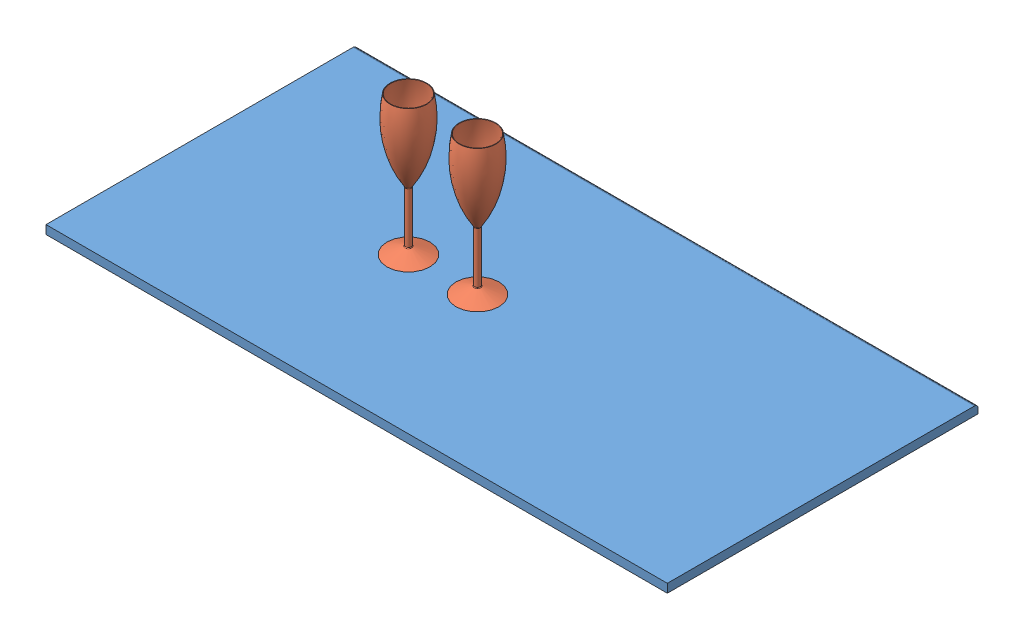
SolidWorks assembly Champagne Glasses.SLDASM, configuration Default (file format 3100). Lengths in mm.
Overall size (914.4 218.23 457.2).
3 component instances, 2 part files, 6 mates.
Components (placement in the parent):
- conter for champagne-3: conter for champagne.SLDPRT [Default] at (124.2699 -153.7162 38.857) size (914.4 12.7 457.2)
- Champagne Glasses For Caustics-2: Champagne Glasses For Caustics.SLDPRT [Default] at (73.4699 -153.7162 38.857) size (63.5 205.53 63.5)
- Champagne Glasses For Caustics-3: Champagne Glasses For Caustics.SLDPRT [Default] at (-28.1301 -153.7162 38.857) size (63.5 205.53 63.5)
Mates (geometry in assembly coordinates):
- Coincident1: coincident aligned: plane of conter for champagne-3 through (-332.9301 -153.7162 267.457) normal (0 1 0); circle of Champagne Glasses For Caustics-2 centre (73.4699 -153.7162 38.857) axis (0 1 0)
- Coincident2: coincident anti-aligned: plane of conter for champagne-3 through (-332.9301 -153.7162 267.457) normal (0 1 0); plane of Champagne Glasses For Caustics-3 through (-28.1301 -153.7162 38.857) normal (0 -1 0)
- Distance1: distance = 508 mm: line of conter for champagne-3; line of Champagne Glasses For Caustics-2
- Distance2: distance = 304.8 mm: line of conter for champagne-3; line of Champagne Glasses For Caustics-3
- Distance3: distance = 228.6 mm: line of conter for champagne-3; line of Champagne Glasses For Caustics-2
- Distance4: distance = 228.6 mm: line of conter for champagne-3; line of Champagne Glasses For Caustics-3
